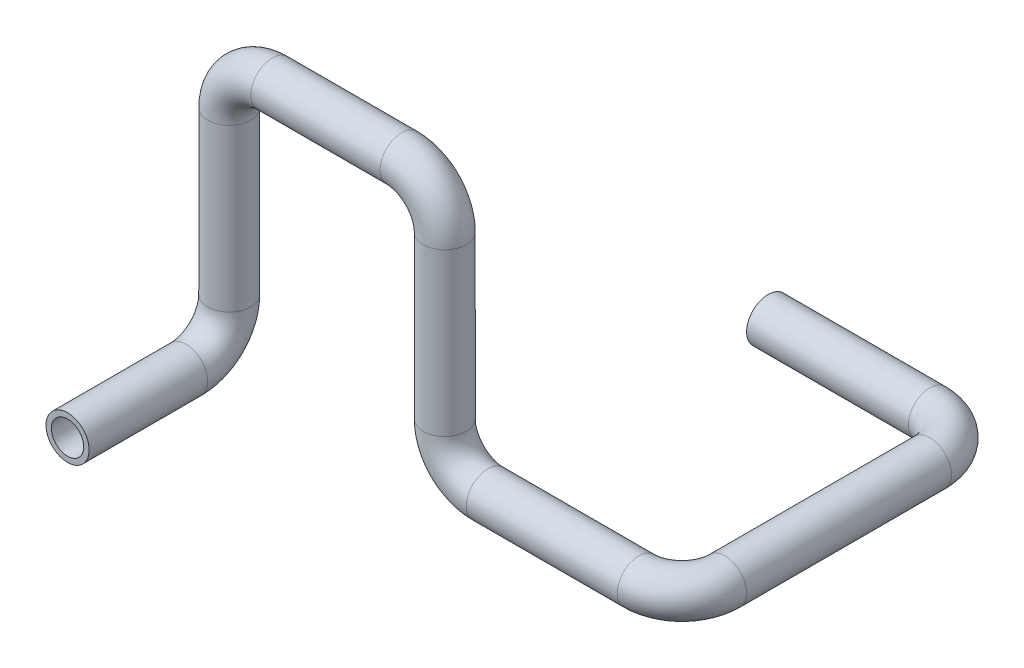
from build123d import *

# Parameters (mm, degrees)
SWEEP_THIN1_PROFILE_R   = 10
SWEEP_THIN1_PROFILE_R_2 = 7.5


with BuildPart() as part:
    # Sweep-Thin1: sweep along a curve in space
    with BuildLine() as sweep_thin1_path:
        Line((0, 0, 0), (75, 0, 0))
        ThreePointArc((75, 0, 0), (89.142135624, 0, 5.857864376), (95, 0, 20))
        Line((95, 0, 20), (95, 0, 115))
        ThreePointArc((95, 0, 115), (89.142135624, 0, 129.142135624), (75, 0, 135))
        Line((75, 0, 135), (5, 0, 135))
        ThreePointArc((5, 0, 135), (-9.142135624, 5.857864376, 135), (-15, 20, 135))
        Line((-15, 20, 135), (-15, 95, 135))
        ThreePointArc((-15, 95, 135), (-20.857864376, 109.142135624, 135), (-35, 115, 135))
        Line((-35, 115, 135), (-95, 115, 135))
        ThreePointArc((-95, 115, 135), (-109.142135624, 109.142135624, 135), (-115, 95, 135))
        Line((-115, 95, 135), (-115, 20, 135))
        ThreePointArc((-115, 20, 135), (-115, 5.857864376, 140.857864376), (-115, 0, 155))
        Line((-115, 0, 155), (-115, 0, 210))
    # Sweep-Thin1 profile (on start of the path) → Sweep-Thin1 (sweep)
    with BuildSketch(Plane(origin=(0, 0, 0), x_dir=(0, 0, 1), z_dir=(1, 0, 0))):
        Circle(SWEEP_THIN1_PROFILE_R)
        Circle(SWEEP_THIN1_PROFILE_R_2, mode=Mode.SUBTRACT)
    sweep(path=sweep_thin1_path.line)


solid = part.part
